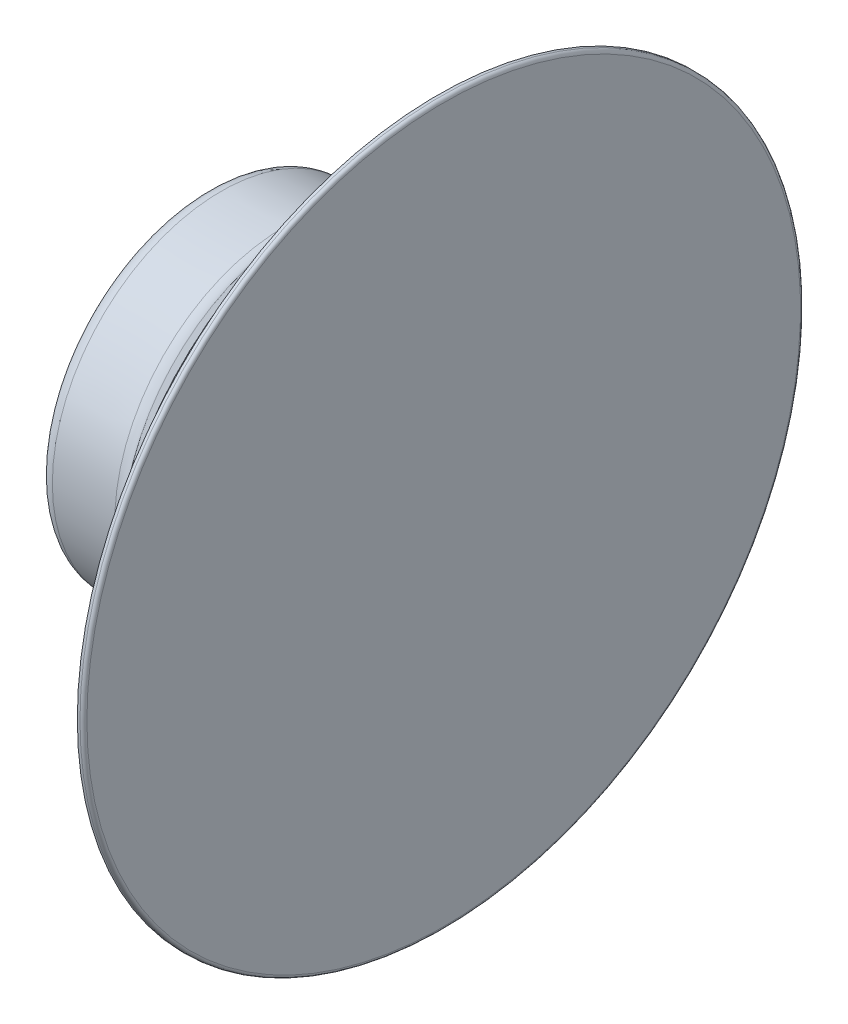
ISO-10303-21;
HEADER;
FILE_DESCRIPTION(('STEP AP214'),'2;1');
FILE_NAME('part.step','',(''),(''),'','','');
FILE_SCHEMA(('AUTOMOTIVE_DESIGN { 1 0 10303 214 1 1 1 1 }'));
ENDSEC;
DATA;
#1=APPLICATION_CONTEXT('core data for automotive mechanical design processes');
#2=APPLICATION_PROTOCOL_DEFINITION('international standard','automotive_design',2000,#1);
#3=PRODUCT_CONTEXT('',#1,'mechanical');
#4=PRODUCT('Part','Part','',(#3));
#5=PRODUCT_RELATED_PRODUCT_CATEGORY('part','',(#4));
#6=PRODUCT_DEFINITION_FORMATION('','',#4);
#7=PRODUCT_DEFINITION_CONTEXT('part definition',#1,'design');
#8=PRODUCT_DEFINITION('design','',#6,#7);
#9=PRODUCT_DEFINITION_SHAPE('','',#8);
#10=(LENGTH_UNIT() NAMED_UNIT(*) SI_UNIT(.MILLI.,.METRE.));
#11=(NAMED_UNIT(*) PLANE_ANGLE_UNIT() SI_UNIT($,.RADIAN.));
#12=(NAMED_UNIT(*) SI_UNIT($,.STERADIAN.) SOLID_ANGLE_UNIT());
#13=UNCERTAINTY_MEASURE_WITH_UNIT(LENGTH_MEASURE(1.E-05),#10,'distance_accuracy_value','');
#14=(GEOMETRIC_REPRESENTATION_CONTEXT(3) GLOBAL_UNCERTAINTY_ASSIGNED_CONTEXT((#13)) GLOBAL_UNIT_ASSIGNED_CONTEXT((#10,
#11,#12)) REPRESENTATION_CONTEXT('',''));
#15=CARTESIAN_POINT('',(0.,0.,0.));
#16=DIRECTION('',(0.,0.,1.));
#17=DIRECTION('',(1.,0.,0.));
#18=AXIS2_PLACEMENT_3D('',#15,#16,#17);
#19=CARTESIAN_POINT('',(0.,0.,0.));
#20=DIRECTION('',(1.,0.,0.));
#21=DIRECTION('',(0.,0.,-1.));
#22=AXIS2_PLACEMENT_3D('',#19,#20,#21);
#23=PLANE('',#22);
#24=CARTESIAN_POINT('',(0.,0.,0.));
#25=DIRECTION('',(1.,0.,0.));
#26=DIRECTION('',(0.,0.,-1.));
#27=AXIS2_PLACEMENT_3D('',#24,#25,#26);
#28=CIRCLE('',#27,8.99251528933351);
#29=CARTESIAN_POINT('',(0.,0.,-8.99251528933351));
#30=VERTEX_POINT('',#29);
#31=EDGE_CURVE('E46',#30,#30,#28,.F.);
#32=ORIENTED_EDGE('',*,*,#31,.T.);
#33=EDGE_LOOP('',(#32));
#34=FACE_BOUND('',#33,.T.);
#35=ADVANCED_FACE('F14',(#34),#23,.F.);
#36=CARTESIAN_POINT('',(5.1943,0.,0.));
#37=DIRECTION('',(1.,0.,0.));
#38=DIRECTION('',(0.,0.,-1.));
#39=AXIS2_PLACEMENT_3D('',#36,#37,#38);
#40=CONICAL_SURFACE('',#39,9.9568,0.0174532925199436);
#41=CARTESIAN_POINT('',(4.59201136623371,0.,0.));
#42=DIRECTION('',(1.,0.,0.));
#43=DIRECTION('',(0.,0.,-1.));
#44=AXIS2_PLACEMENT_3D('',#41,#42,#43);
#45=CIRCLE('',#44,9.94628701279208);
#46=CARTESIAN_POINT('',(4.59201136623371,0.,-9.94628701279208));
#47=VERTEX_POINT('',#46);
#48=EDGE_CURVE('E36',#47,#47,#45,.F.);
#49=ORIENTED_EDGE('',*,*,#48,.T.);
#50=EDGE_LOOP('',(#49));
#51=FACE_BOUND('',#50,.T.);
#52=CARTESIAN_POINT('',(0.873484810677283,0.,0.));
#53=DIRECTION('',(-1.,0.,0.));
#54=DIRECTION('',(0.,0.,1.));
#55=AXIS2_PLACEMENT_3D('',#52,#53,#54);
#56=CIRCLE('',#55,9.88137989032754);
#57=CARTESIAN_POINT('',(0.873484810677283,0.,9.88137989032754));
#58=VERTEX_POINT('',#57);
#59=EDGE_CURVE('E42',#58,#58,#56,.F.);
#60=ORIENTED_EDGE('',*,*,#59,.T.);
#61=EDGE_LOOP('',(#60));
#62=FACE_BOUND('',#61,.T.);
#63=ADVANCED_FACE('F82',(#51,#62),#40,.T.);
#64=CARTESIAN_POINT('',(9.40308,0.,0.));
#65=DIRECTION('',(1.,0.,0.));
#66=DIRECTION('',(0.,0.,-1.));
#67=AXIS2_PLACEMENT_3D('',#64,#65,#66);
#68=CONICAL_SURFACE('',#67,15.29588,0.903232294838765);
#69=CARTESIAN_POINT('',(5.56721850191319,0.,0.));
#70=DIRECTION('',(1.,0.,0.));
#71=DIRECTION('',(0.,0.,-1.));
#72=AXIS2_PLACEMENT_3D('',#69,#70,#71);
#73=CIRCLE('',#72,10.4298686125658);
#74=CARTESIAN_POINT('',(5.56721850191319,0.,-10.4298686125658));
#75=VERTEX_POINT('',#74);
#76=EDGE_CURVE('E30',#75,#75,#73,.T.);
#77=ORIENTED_EDGE('',*,*,#76,.T.);
#78=EDGE_LOOP('',(#77));
#79=FACE_BOUND('',#78,.T.);
#80=CARTESIAN_POINT('',(9.40308,0.,0.));
#81=DIRECTION('',(-1.,0.,0.));
#82=DIRECTION('',(0.,0.,1.));
#83=AXIS2_PLACEMENT_3D('',#80,#81,#82);
#84=CIRCLE('',#83,15.29588);
#85=CARTESIAN_POINT('',(9.40308,0.,15.29588));
#86=VERTEX_POINT('',#85);
#87=EDGE_CURVE('E50',#86,#86,#84,.T.);
#88=ORIENTED_EDGE('',*,*,#87,.T.);
#89=EDGE_LOOP('',(#88));
#90=FACE_BOUND('',#89,.T.);
#91=ADVANCED_FACE('F89',(#79,#90),#68,.T.);
#92=CARTESIAN_POINT('',(10.80262,0.,0.));
#93=DIRECTION('',(1.,0.,0.));
#94=DIRECTION('',(0.,0.,-1.));
#95=AXIS2_PLACEMENT_3D('',#92,#93,#94);
#96=CONICAL_SURFACE('',#95,16.27632,0.611091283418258);
#97=ORIENTED_EDGE('',*,*,#87,.F.);
#98=EDGE_LOOP('',(#97));
#99=FACE_BOUND('',#98,.T.);
#100=CARTESIAN_POINT('',(10.80262,0.,0.));
#101=DIRECTION('',(-1.,0.,0.));
#102=DIRECTION('',(0.,0.,1.));
#103=AXIS2_PLACEMENT_3D('',#100,#101,#102);
#104=CIRCLE('',#103,16.27632);
#105=CARTESIAN_POINT('',(10.80262,0.,16.27632));
#106=VERTEX_POINT('',#105);
#107=EDGE_CURVE('E54',#106,#106,#104,.T.);
#108=ORIENTED_EDGE('',*,*,#107,.T.);
#109=EDGE_LOOP('',(#108));
#110=FACE_BOUND('',#109,.T.);
#111=ADVANCED_FACE('F78',(#99,#110),#96,.T.);
#112=CARTESIAN_POINT('',(13.53566,0.,0.));
#113=DIRECTION('',(1.,0.,0.));
#114=DIRECTION('',(0.,0.,-1.));
#115=AXIS2_PLACEMENT_3D('',#112,#113,#114);
#116=CONICAL_SURFACE('',#115,21.082,1.05370172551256);
#117=ORIENTED_EDGE('',*,*,#107,.F.);
#118=EDGE_LOOP('',(#117));
#119=FACE_BOUND('',#118,.T.);
#120=CARTESIAN_POINT('',(13.53566,0.,0.));
#121=DIRECTION('',(-1.,0.,0.));
#122=DIRECTION('',(0.,0.,1.));
#123=AXIS2_PLACEMENT_3D('',#120,#121,#122);
#124=CIRCLE('',#123,21.082);
#125=CARTESIAN_POINT('',(13.53566,0.,21.082));
#126=VERTEX_POINT('',#125);
#127=EDGE_CURVE('E58',#126,#126,#124,.T.);
#128=ORIENTED_EDGE('',*,*,#127,.T.);
#129=EDGE_LOOP('',(#128));
#130=FACE_BOUND('',#129,.T.);
#131=ADVANCED_FACE('F64',(#119,#130),#116,.T.);
#132=CARTESIAN_POINT('',(0.,0.,0.));
#133=DIRECTION('',(-1.,0.,0.));
#134=DIRECTION('',(0.,0.,1.));
#135=AXIS2_PLACEMENT_3D('',#132,#133,#134);
#136=CYLINDRICAL_SURFACE('',#135,21.082);
#137=CARTESIAN_POINT('',(13.6906,0.,0.));
#138=DIRECTION('',(-1.,0.,0.));
#139=DIRECTION('',(0.,0.,1.));
#140=AXIS2_PLACEMENT_3D('',#137,#138,#139);
#141=CIRCLE('',#140,21.082);
#142=CARTESIAN_POINT('',(13.6906,0.,21.082));
#143=VERTEX_POINT('',#142);
#144=EDGE_CURVE('E22',#143,#143,#141,.T.);
#145=ORIENTED_EDGE('',*,*,#144,.T.);
#146=EDGE_LOOP('',(#145));
#147=FACE_BOUND('',#146,.T.);
#148=ORIENTED_EDGE('',*,*,#127,.F.);
#149=EDGE_LOOP('',(#148));
#150=FACE_BOUND('',#149,.T.);
#151=ADVANCED_FACE('F66',(#147,#150),#136,.T.);
#152=CARTESIAN_POINT('',(13.8938,21.082,0.));
#153=DIRECTION('',(-1.,0.,0.));
#154=DIRECTION('',(0.,0.,1.));
#155=AXIS2_PLACEMENT_3D('',#152,#153,#154);
#156=PLANE('',#155);
#157=CARTESIAN_POINT('',(13.8938,0.,0.));
#158=DIRECTION('',(-1.,0.,0.));
#159=DIRECTION('',(0.,0.,1.));
#160=AXIS2_PLACEMENT_3D('',#157,#158,#159);
#161=CIRCLE('',#160,20.8788);
#162=CARTESIAN_POINT('',(13.8938,0.,20.8788));
#163=VERTEX_POINT('',#162);
#164=EDGE_CURVE('E9',#163,#163,#161,.F.);
#165=ORIENTED_EDGE('',*,*,#164,.T.);
#166=EDGE_LOOP('',(#165));
#167=FACE_BOUND('',#166,.T.);
#168=ADVANCED_FACE('F68',(#167),#156,.F.);
#169=CARTESIAN_POINT('',(0.889,0.,0.));
#170=DIRECTION('',(1.,0.,0.));
#171=DIRECTION('',(0.,0.,-1.));
#172=AXIS2_PLACEMENT_3D('',#169,#170,#171);
#173=TOROIDAL_SURFACE('',#172,8.99251528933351,0.889);
#174=ORIENTED_EDGE('',*,*,#59,.F.);
#175=EDGE_LOOP('',(#174));
#176=FACE_BOUND('',#175,.T.);
#177=ORIENTED_EDGE('',*,*,#31,.F.);
#178=EDGE_LOOP('',(#177));
#179=FACE_BOUND('',#178,.T.);
#180=ADVANCED_FACE('F76',(#176,#179),#173,.T.);
#181=CARTESIAN_POINT('',(4.56984681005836,0.,0.));
#182=DIRECTION('',(-1.,0.,0.));
#183=DIRECTION('',(0.,0.,1.));
#184=AXIS2_PLACEMENT_3D('',#181,#182,#183);
#185=TOROIDAL_SURFACE('',#184,11.2160935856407,1.27);
#186=ORIENTED_EDGE('',*,*,#76,.F.);
#187=EDGE_LOOP('',(#186));
#188=FACE_BOUND('',#187,.T.);
#189=ORIENTED_EDGE('',*,*,#48,.F.);
#190=EDGE_LOOP('',(#189));
#191=FACE_BOUND('',#190,.T.);
#192=ADVANCED_FACE('F95',(#188,#191),#185,.F.);
#193=CARTESIAN_POINT('',(13.6906,0.,0.));
#194=DIRECTION('',(-1.,0.,0.));
#195=DIRECTION('',(0.,0.,1.));
#196=AXIS2_PLACEMENT_3D('',#193,#194,#195);
#197=TOROIDAL_SURFACE('',#196,20.8788,0.2032);
#198=ORIENTED_EDGE('',*,*,#164,.F.);
#199=EDGE_LOOP('',(#198));
#200=FACE_BOUND('',#199,.T.);
#201=ORIENTED_EDGE('',*,*,#144,.F.);
#202=EDGE_LOOP('',(#201));
#203=FACE_BOUND('',#202,.T.);
#204=ADVANCED_FACE('F16',(#200,#203),#197,.T.);
#205=CLOSED_SHELL('',(#35,#63,#91,#111,#131,#151,#168,#180,#192,#204));
#206=MANIFOLD_SOLID_BREP('B1',#205);
#207=ADVANCED_BREP_SHAPE_REPRESENTATION('',(#18,#206),#14);
#208=SHAPE_DEFINITION_REPRESENTATION(#9,#207);
ENDSEC;
END-ISO-10303-21;
